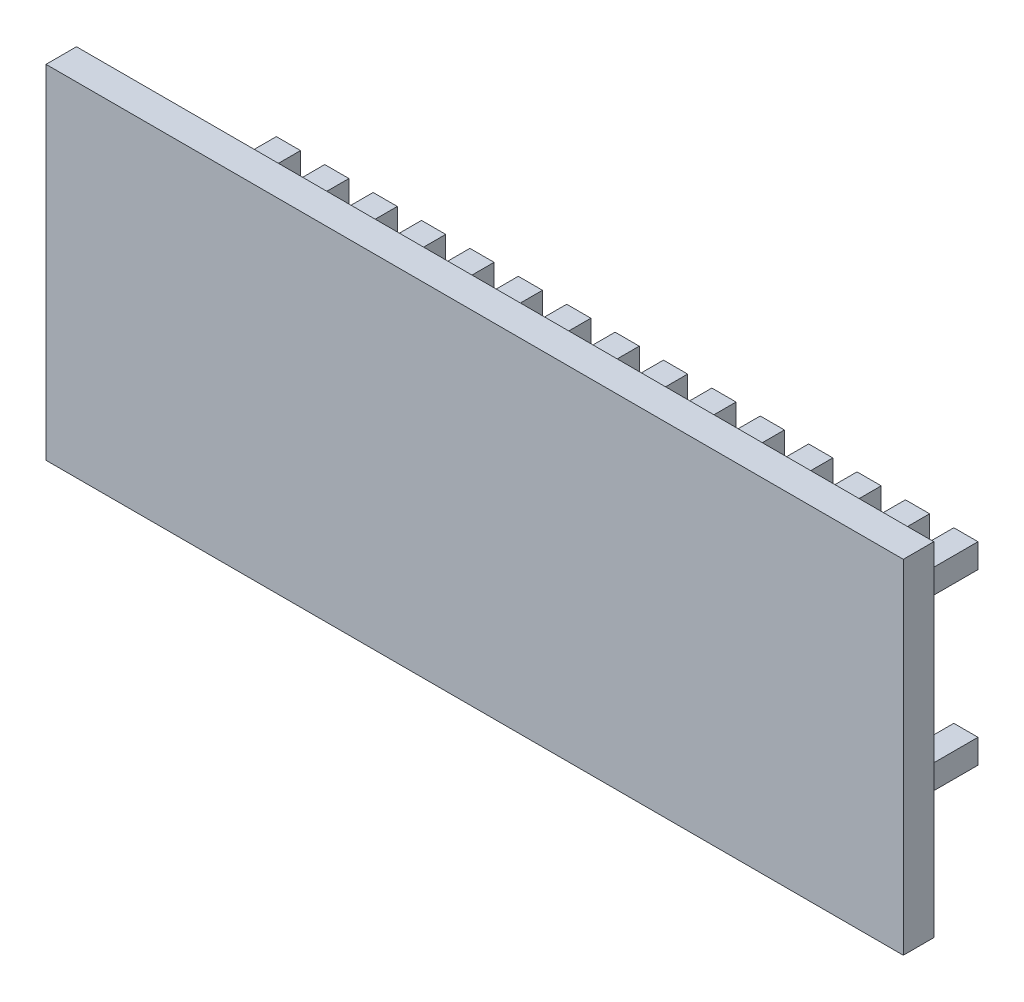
from build123d import *

# Parameters (mm, degrees)
SKETCH1_W           = 45
SKETCH1_H           = 18
BOSS_EXTRUDE2_DEPTH = 1.6
SKETCH2_W           = 1.27
SKETCH2_H           = 1.27
BOSS_EXTRUDE3_DEPTH = 5.08


with BuildPart() as part:
    # Sketch1 → Boss-Extrude2 (new body)
    with BuildSketch(Plane.XY):
        Rectangle(SKETCH1_W, SKETCH1_H)
    extrude(amount=BOSS_EXTRUDE2_DEPTH)

    # Sketch2 → Boss-Extrude3 (add)
    with BuildSketch(Plane(origin=(0, 0, 0), x_dir=(-1, 0, 0), z_dir=(0, 0, -1))):
        with Locations((-19.105, 4.445)):
            Rectangle(SKETCH2_W, SKETCH2_H)
        with Locations((-16.565, 4.445)):
            Rectangle(SKETCH2_W, SKETCH2_H)
        with Locations((-14.025, 4.445)):
            Rectangle(SKETCH2_W, SKETCH2_H)
        with Locations((-11.485, 4.445)):
            Rectangle(SKETCH2_W, SKETCH2_H)
        with Locations((-8.945, 4.445)):
            Rectangle(SKETCH2_W, SKETCH2_H)
        with Locations((-6.405, 4.445)):
            Rectangle(SKETCH2_W, SKETCH2_H)
        with Locations((-3.865, 4.445)):
            Rectangle(SKETCH2_W, SKETCH2_H)
        with Locations((-1.325, 4.445)):
            Rectangle(SKETCH2_W, SKETCH2_H)
        with Locations((1.215, 4.445)):
            Rectangle(SKETCH2_W, SKETCH2_H)
        with Locations((3.755, 4.445)):
            Rectangle(SKETCH2_W, SKETCH2_H)
        with Locations((6.295, 4.445)):
            Rectangle(SKETCH2_W, SKETCH2_H)
        with Locations((8.835, 4.445)):
            Rectangle(SKETCH2_W, SKETCH2_H)
        with Locations((11.375, 4.445)):
            Rectangle(SKETCH2_W, SKETCH2_H)
        with Locations((13.915, 4.445)):
            Rectangle(SKETCH2_W, SKETCH2_H)
        with Locations((16.455, 4.445)):
            Rectangle(SKETCH2_W, SKETCH2_H)
        with Locations((16.455, -4.445)):
            Rectangle(SKETCH2_W, SKETCH2_H)
        with Locations((13.915, -4.445)):
            Rectangle(SKETCH2_W, SKETCH2_H)
        with Locations((11.375, -4.445)):
            Rectangle(SKETCH2_W, SKETCH2_H)
        with Locations((8.835, -4.445)):
            Rectangle(SKETCH2_W, SKETCH2_H)
        with Locations((6.295, -4.445)):
            Rectangle(SKETCH2_W, SKETCH2_H)
        with Locations((3.755, -4.445)):
            Rectangle(SKETCH2_W, SKETCH2_H)
        with Locations((1.215, -4.445)):
            Rectangle(SKETCH2_W, SKETCH2_H)
        with Locations((-1.325, -4.445)):
            Rectangle(SKETCH2_W, SKETCH2_H)
        with Locations((-3.865, -4.445)):
            Rectangle(SKETCH2_W, SKETCH2_H)
        with Locations((-6.405, -4.445)):
            Rectangle(SKETCH2_W, SKETCH2_H)
        with Locations((-8.945, -4.445)):
            Rectangle(SKETCH2_W, SKETCH2_H)
        with Locations((-11.485, -4.445)):
            Rectangle(SKETCH2_W, SKETCH2_H)
        with Locations((-14.025, -4.445)):
            Rectangle(SKETCH2_W, SKETCH2_H)
        with Locations((-16.565, -4.445)):
            Rectangle(SKETCH2_W, SKETCH2_H)
        with Locations((-19.105, -4.445)):
            Rectangle(SKETCH2_W, SKETCH2_H)
    extrude(amount=BOSS_EXTRUDE3_DEPTH)


solid = part.part
